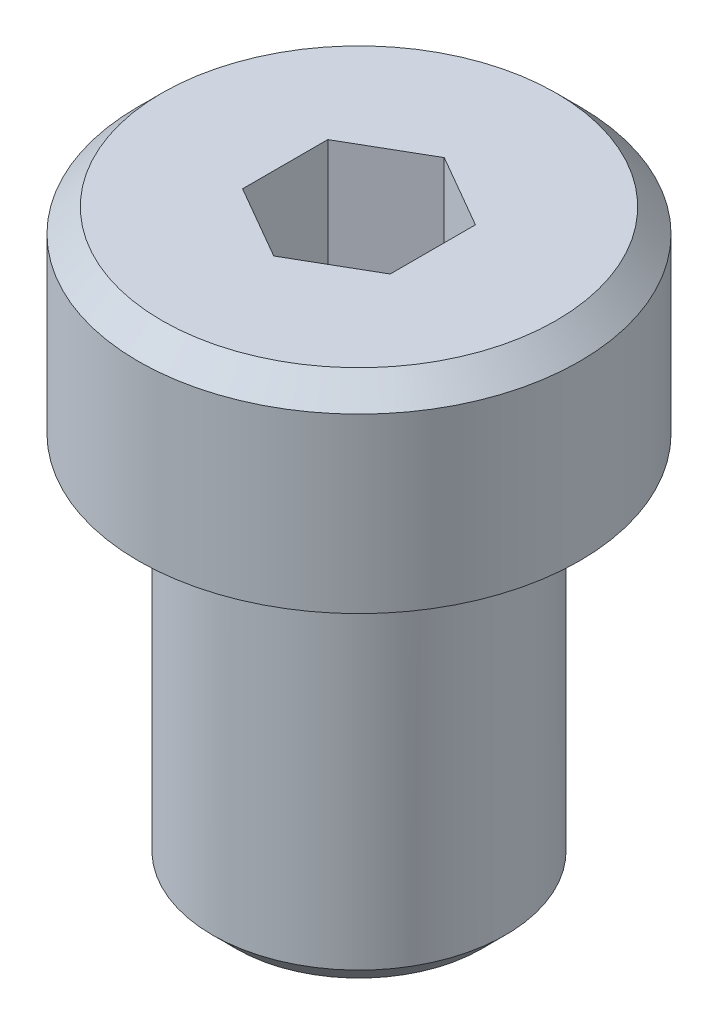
ISO-10303-21;
HEADER;
FILE_DESCRIPTION(('STEP AP214'),'2;1');
FILE_NAME('part.step','',(''),(''),'','','');
FILE_SCHEMA(('AUTOMOTIVE_DESIGN { 1 0 10303 214 1 1 1 1 }'));
ENDSEC;
DATA;
#1=APPLICATION_CONTEXT('core data for automotive mechanical design processes');
#2=APPLICATION_PROTOCOL_DEFINITION('international standard','automotive_design',2000,#1);
#3=PRODUCT_CONTEXT('',#1,'mechanical');
#4=PRODUCT('Part','Part','',(#3));
#5=PRODUCT_RELATED_PRODUCT_CATEGORY('part','',(#4));
#6=PRODUCT_DEFINITION_FORMATION('','',#4);
#7=PRODUCT_DEFINITION_CONTEXT('part definition',#1,'design');
#8=PRODUCT_DEFINITION('design','',#6,#7);
#9=PRODUCT_DEFINITION_SHAPE('','',#8);
#10=(LENGTH_UNIT() NAMED_UNIT(*) SI_UNIT(.MILLI.,.METRE.));
#11=(NAMED_UNIT(*) PLANE_ANGLE_UNIT() SI_UNIT($,.RADIAN.));
#12=(NAMED_UNIT(*) SI_UNIT($,.STERADIAN.) SOLID_ANGLE_UNIT());
#13=UNCERTAINTY_MEASURE_WITH_UNIT(LENGTH_MEASURE(1.E-05),#10,'distance_accuracy_value','');
#14=(GEOMETRIC_REPRESENTATION_CONTEXT(3) GLOBAL_UNCERTAINTY_ASSIGNED_CONTEXT((#13)) GLOBAL_UNIT_ASSIGNED_CONTEXT((#10,
#11,#12)) REPRESENTATION_CONTEXT('',''));
#15=CARTESIAN_POINT('',(0.,0.,0.));
#16=DIRECTION('',(0.,0.,1.));
#17=DIRECTION('',(1.,0.,0.));
#18=AXIS2_PLACEMENT_3D('',#15,#16,#17);
#19=CARTESIAN_POINT('',(0.,0.,0.));
#20=DIRECTION('',(0.,-1.,0.));
#21=DIRECTION('',(1.,0.,0.));
#22=AXIS2_PLACEMENT_3D('',#19,#20,#21);
#23=PLANE('',#22);
#24=CARTESIAN_POINT('',(0.,0.,0.));
#25=DIRECTION('',(0.,-1.,0.));
#26=DIRECTION('',(1.,0.,0.));
#27=AXIS2_PLACEMENT_3D('',#24,#25,#26);
#28=CIRCLE('',#27,4.7371);
#29=CARTESIAN_POINT('',(4.7371,0.,0.));
#30=VERTEX_POINT('',#29);
#31=EDGE_CURVE('E148',#30,#30,#28,.T.);
#32=ORIENTED_EDGE('',*,*,#31,.F.);
#33=EDGE_LOOP('',(#32));
#34=FACE_BOUND('',#33,.T.);
#35=CARTESIAN_POINT('',(0.,0.,0.));
#36=DIRECTION('',(0.,-1.,0.));
#37=DIRECTION('',(1.,0.,0.));
#38=AXIS2_PLACEMENT_3D('',#35,#36,#37);
#39=CIRCLE('',#38,7.137393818);
#40=CARTESIAN_POINT('',(7.137393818,0.,0.));
#41=VERTEX_POINT('',#40);
#42=EDGE_CURVE('E145',#41,#41,#39,.T.);
#43=ORIENTED_EDGE('',*,*,#42,.T.);
#44=EDGE_LOOP('',(#43));
#45=FACE_BOUND('',#44,.T.);
#46=ADVANCED_FACE('F32',(#34,#45),#23,.T.);
#47=CARTESIAN_POINT('',(0.,0.,0.));
#48=DIRECTION('',(0.,-1.,0.));
#49=DIRECTION('',(1.,0.,0.));
#50=AXIS2_PLACEMENT_3D('',#47,#48,#49);
#51=CYLINDRICAL_SURFACE('',#50,7.137393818);
#52=CARTESIAN_POINT('',(0.,5.5879945,0.));
#53=DIRECTION('',(0.,-1.,0.));
#54=DIRECTION('',(1.,0.,0.));
#55=AXIS2_PLACEMENT_3D('',#52,#53,#54);
#56=CIRCLE('',#55,7.137393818);
#57=CARTESIAN_POINT('',(7.137393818,5.5879945,0.));
#58=VERTEX_POINT('',#57);
#59=EDGE_CURVE('E142',#58,#58,#56,.T.);
#60=ORIENTED_EDGE('',*,*,#59,.T.);
#61=EDGE_LOOP('',(#60));
#62=FACE_BOUND('',#61,.T.);
#63=ORIENTED_EDGE('',*,*,#42,.F.);
#64=EDGE_LOOP('',(#63));
#65=FACE_BOUND('',#64,.T.);
#66=ADVANCED_FACE('F164',(#62,#65),#51,.T.);
#67=CARTESIAN_POINT('',(0.,5.5879945,0.));
#68=DIRECTION('',(0.,-1.,0.));
#69=DIRECTION('',(1.,0.,0.));
#70=AXIS2_PLACEMENT_3D('',#67,#68,#69);
#71=CONICAL_SURFACE('',#70,7.137393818,0.785398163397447);
#72=CARTESIAN_POINT('',(0.,6.3499945,0.));
#73=DIRECTION('',(0.,-1.,0.));
#74=DIRECTION('',(1.,0.,0.));
#75=AXIS2_PLACEMENT_3D('',#72,#73,#74);
#76=CIRCLE('',#75,6.375393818);
#77=CARTESIAN_POINT('',(6.375393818,6.3499945,0.));
#78=VERTEX_POINT('',#77);
#79=EDGE_CURVE('E134',#78,#78,#76,.T.);
#80=ORIENTED_EDGE('',*,*,#79,.T.);
#81=EDGE_LOOP('',(#80));
#82=FACE_BOUND('',#81,.T.);
#83=ORIENTED_EDGE('',*,*,#59,.F.);
#84=EDGE_LOOP('',(#83));
#85=FACE_BOUND('',#84,.T.);
#86=ADVANCED_FACE('F169',(#82,#85),#71,.T.);
#87=CARTESIAN_POINT('',(6.375393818,6.3499945,0.));
#88=DIRECTION('',(0.,1.,0.));
#89=DIRECTION('',(-1.,0.,0.));
#90=AXIS2_PLACEMENT_3D('',#87,#88,#89);
#91=PLANE('',#90);
#92=DIRECTION('',(-4.53589793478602E-07,0.,0.999999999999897));
#93=VECTOR('',#92,1.);
#94=CARTESIAN_POINT('',(-2.38759668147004,6.3499945,-1.37848223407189));
#95=LINE('',#94,#93);
#96=CARTESIAN_POINT('',(-2.38759668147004,6.3499945,-1.37848223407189));
#97=VERTEX_POINT('',#96);
#98=CARTESIAN_POINT('',(-2.387597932,6.3499945,1.37848006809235));
#99=VERTEX_POINT('',#98);
#100=EDGE_CURVE('E47',#97,#99,#95,.T.);
#101=ORIENTED_EDGE('',*,*,#100,.F.);
#102=DIRECTION('',(-0.866025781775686,0.,0.499999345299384));
#103=VECTOR('',#102,1.);
#104=CARTESIAN_POINT('',(1.87579371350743E-06,6.3499945,-2.75696049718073));
#105=LINE('',#104,#103);
#106=CARTESIAN_POINT('',(1.87579371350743E-06,6.3499945,-2.75696049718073));
#107=VERTEX_POINT('',#106);
#108=EDGE_CURVE('E130',#107,#97,#105,.T.);
#109=ORIENTED_EDGE('',*,*,#108,.F.);
#110=DIRECTION('',(-0.866025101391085,0.,-0.500000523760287));
#111=VECTOR('',#110,1.);
#112=CARTESIAN_POINT('',(2.38759855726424,6.3499945,-1.37847898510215));
#113=LINE('',#112,#111);
#114=CARTESIAN_POINT('',(2.38759855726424,6.3499945,-1.37847898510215));
#115=VERTEX_POINT('',#114);
#116=EDGE_CURVE('E128',#115,#107,#113,.T.);
#117=ORIENTED_EDGE('',*,*,#116,.F.);
#118=DIRECTION('',(4.53589793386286E-07,0.,-0.999999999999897));
#119=VECTOR('',#118,1.);
#120=CARTESIAN_POINT('',(2.38759730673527,6.3499945,1.37848115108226));
#121=LINE('',#120,#119);
#122=CARTESIAN_POINT('',(2.38759730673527,6.3499945,1.37848115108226));
#123=VERTEX_POINT('',#122);
#124=EDGE_CURVE('E95',#123,#115,#121,.T.);
#125=ORIENTED_EDGE('',*,*,#124,.F.);
#126=DIRECTION('',(0.866025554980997,0.,-0.499999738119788));
#127=VECTOR('',#126,1.);
#128=CARTESIAN_POINT('',(-6.25264571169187E-07,6.3499945,2.7569604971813));
#129=LINE('',#128,#127);
#130=CARTESIAN_POINT('',(-6.25264571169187E-07,6.3499945,2.7569604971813));
#131=VERTEX_POINT('',#130);
#132=EDGE_CURVE('E124',#131,#123,#129,.T.);
#133=ORIENTED_EDGE('',*,*,#132,.F.);
#134=DIRECTION('',(0.86602532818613,0.,0.500000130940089));
#135=VECTOR('',#134,1.);
#136=CARTESIAN_POINT('',(-2.387597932,6.3499945,1.37848006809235));
#137=LINE('',#136,#135);
#138=EDGE_CURVE('E121',#99,#131,#137,.T.);
#139=ORIENTED_EDGE('',*,*,#138,.F.);
#140=EDGE_LOOP('',(#101,#109,#117,#125,#133,#139));
#141=FACE_BOUND('',#140,.T.);
#142=ORIENTED_EDGE('',*,*,#79,.F.);
#143=EDGE_LOOP('',(#142));
#144=FACE_BOUND('',#143,.T.);
#145=ADVANCED_FACE('F177',(#141,#144),#91,.T.);
#146=CARTESIAN_POINT('',(0.,-12.446,0.));
#147=DIRECTION('',(0.,-1.,0.));
#148=DIRECTION('',(0.,0.,-1.));
#149=AXIS2_PLACEMENT_3D('',#146,#147,#148);
#150=PLANE('',#149);
#151=CARTESIAN_POINT('',(0.,-12.446,0.));
#152=DIRECTION('',(0.,-1.,0.));
#153=DIRECTION('',(0.,0.,-1.));
#154=AXIS2_PLACEMENT_3D('',#151,#152,#153);
#155=CIRCLE('',#154,3.9751);
#156=CARTESIAN_POINT('',(0.,-12.446,-3.9751));
#157=VERTEX_POINT('',#156);
#158=EDGE_CURVE('E40',#157,#157,#155,.T.);
#159=ORIENTED_EDGE('',*,*,#158,.T.);
#160=EDGE_LOOP('',(#159));
#161=FACE_BOUND('',#160,.T.);
#162=ADVANCED_FACE('F153',(#161),#150,.T.);
#163=CARTESIAN_POINT('',(0.,0.,0.));
#164=DIRECTION('',(0.,-1.,0.));
#165=DIRECTION('',(0.,0.,-1.));
#166=AXIS2_PLACEMENT_3D('',#163,#164,#165);
#167=CYLINDRICAL_SURFACE('',#166,4.7371);
#168=CARTESIAN_POINT('',(0.,-11.684,0.));
#169=DIRECTION('',(0.,-1.,0.));
#170=DIRECTION('',(0.,0.,-1.));
#171=AXIS2_PLACEMENT_3D('',#168,#169,#170);
#172=CIRCLE('',#171,4.7371);
#173=CARTESIAN_POINT('',(0.,-11.684,-4.7371));
#174=VERTEX_POINT('',#173);
#175=EDGE_CURVE('E11',#174,#174,#172,.F.);
#176=ORIENTED_EDGE('',*,*,#175,.T.);
#177=EDGE_LOOP('',(#176));
#178=FACE_BOUND('',#177,.T.);
#179=ORIENTED_EDGE('',*,*,#31,.T.);
#180=EDGE_LOOP('',(#179));
#181=FACE_BOUND('',#180,.T.);
#182=ADVANCED_FACE('F184',(#178,#181),#167,.T.);
#183=CARTESIAN_POINT('',(-2.38759668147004,2.768597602,-1.37848223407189));
#184=DIRECTION('',(-0.999999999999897,0.,-4.53589793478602E-07));
#185=DIRECTION('',(-4.53589793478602E-07,0.,0.999999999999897));
#186=AXIS2_PLACEMENT_3D('',#183,#184,#185);
#187=PLANE('',#186);
#188=ORIENTED_EDGE('',*,*,#100,.T.);
#189=DIRECTION('',(0.,1.,0.));
#190=VECTOR('',#189,1.);
#191=CARTESIAN_POINT('',(-2.387597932,2.768597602,1.37848006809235));
#192=LINE('',#191,#190);
#193=CARTESIAN_POINT('',(-2.387597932,2.768597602,1.37848006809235));
#194=VERTEX_POINT('',#193);
#195=EDGE_CURVE('E77',#194,#99,#192,.T.);
#196=ORIENTED_EDGE('',*,*,#195,.F.);
#197=DIRECTION('',(-4.53589793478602E-07,0.,0.999999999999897));
#198=VECTOR('',#197,1.);
#199=CARTESIAN_POINT('',(-2.38759668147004,2.768597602,-1.37848223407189));
#200=LINE('',#199,#198);
#201=CARTESIAN_POINT('',(-2.38759668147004,2.768597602,-1.37848223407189));
#202=VERTEX_POINT('',#201);
#203=EDGE_CURVE('E132',#202,#194,#200,.T.);
#204=ORIENTED_EDGE('',*,*,#203,.F.);
#205=DIRECTION('',(0.,1.,0.));
#206=VECTOR('',#205,1.);
#207=CARTESIAN_POINT('',(-2.38759668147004,2.768597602,-1.37848223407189));
#208=LINE('',#207,#206);
#209=EDGE_CURVE('E55',#202,#97,#208,.T.);
#210=ORIENTED_EDGE('',*,*,#209,.T.);
#211=EDGE_LOOP('',(#188,#196,#204,#210));
#212=FACE_BOUND('',#211,.T.);
#213=ADVANCED_FACE('F187',(#212),#187,.F.);
#214=CARTESIAN_POINT('',(1.87579371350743E-06,2.768597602,-2.75696049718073));
#215=DIRECTION('',(-0.499999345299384,0.,-0.866025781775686));
#216=DIRECTION('',(-0.866025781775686,0.,0.499999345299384));
#217=AXIS2_PLACEMENT_3D('',#214,#215,#216);
#218=PLANE('',#217);
#219=ORIENTED_EDGE('',*,*,#108,.T.);
#220=ORIENTED_EDGE('',*,*,#209,.F.);
#221=DIRECTION('',(-0.866025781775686,0.,0.499999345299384));
#222=VECTOR('',#221,1.);
#223=CARTESIAN_POINT('',(1.87579371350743E-06,2.768597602,-2.75696049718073));
#224=LINE('',#223,#222);
#225=CARTESIAN_POINT('',(1.87579371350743E-06,2.768597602,-2.75696049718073));
#226=VERTEX_POINT('',#225);
#227=EDGE_CURVE('E107',#226,#202,#224,.T.);
#228=ORIENTED_EDGE('',*,*,#227,.F.);
#229=DIRECTION('',(0.,1.,0.));
#230=VECTOR('',#229,1.);
#231=CARTESIAN_POINT('',(1.87579371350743E-06,2.768597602,-2.75696049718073));
#232=LINE('',#231,#230);
#233=EDGE_CURVE('E99',#226,#107,#232,.T.);
#234=ORIENTED_EDGE('',*,*,#233,.T.);
#235=EDGE_LOOP('',(#219,#220,#228,#234));
#236=FACE_BOUND('',#235,.T.);
#237=ADVANCED_FACE('F191',(#236),#218,.F.);
#238=CARTESIAN_POINT('',(2.38759855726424,2.768597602,-1.37847898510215));
#239=DIRECTION('',(0.500000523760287,0.,-0.866025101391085));
#240=DIRECTION('',(-0.866025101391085,0.,-0.500000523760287));
#241=AXIS2_PLACEMENT_3D('',#238,#239,#240);
#242=PLANE('',#241);
#243=ORIENTED_EDGE('',*,*,#116,.T.);
#244=ORIENTED_EDGE('',*,*,#233,.F.);
#245=DIRECTION('',(-0.866025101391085,0.,-0.500000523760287));
#246=VECTOR('',#245,1.);
#247=CARTESIAN_POINT('',(2.38759855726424,2.768597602,-1.37847898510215));
#248=LINE('',#247,#246);
#249=CARTESIAN_POINT('',(2.38759855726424,2.768597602,-1.37847898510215));
#250=VERTEX_POINT('',#249);
#251=EDGE_CURVE('E103',#250,#226,#248,.T.);
#252=ORIENTED_EDGE('',*,*,#251,.F.);
#253=DIRECTION('',(0.,1.,0.));
#254=VECTOR('',#253,1.);
#255=CARTESIAN_POINT('',(2.38759855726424,2.768597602,-1.37847898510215));
#256=LINE('',#255,#254);
#257=EDGE_CURVE('E88',#250,#115,#256,.T.);
#258=ORIENTED_EDGE('',*,*,#257,.T.);
#259=EDGE_LOOP('',(#243,#244,#252,#258));
#260=FACE_BOUND('',#259,.T.);
#261=ADVANCED_FACE('F104',(#260),#242,.F.);
#262=CARTESIAN_POINT('',(2.38759730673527,2.768597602,1.37848115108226));
#263=DIRECTION('',(0.999999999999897,0.,4.53589793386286E-07));
#264=DIRECTION('',(4.53589793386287E-07,0.,-0.999999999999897));
#265=AXIS2_PLACEMENT_3D('',#262,#263,#264);
#266=PLANE('',#265);
#267=ORIENTED_EDGE('',*,*,#124,.T.);
#268=ORIENTED_EDGE('',*,*,#257,.F.);
#269=DIRECTION('',(4.53589793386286E-07,0.,-0.999999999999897));
#270=VECTOR('',#269,1.);
#271=CARTESIAN_POINT('',(2.38759730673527,2.768597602,1.37848115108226));
#272=LINE('',#271,#270);
#273=CARTESIAN_POINT('',(2.38759730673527,2.768597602,1.37848115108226));
#274=VERTEX_POINT('',#273);
#275=EDGE_CURVE('E92',#274,#250,#272,.T.);
#276=ORIENTED_EDGE('',*,*,#275,.F.);
#277=DIRECTION('',(0.,1.,0.));
#278=VECTOR('',#277,1.);
#279=CARTESIAN_POINT('',(2.38759730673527,2.768597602,1.37848115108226));
#280=LINE('',#279,#278);
#281=EDGE_CURVE('E100',#274,#123,#280,.T.);
#282=ORIENTED_EDGE('',*,*,#281,.T.);
#283=EDGE_LOOP('',(#267,#268,#276,#282));
#284=FACE_BOUND('',#283,.T.);
#285=ADVANCED_FACE('F90',(#284),#266,.F.);
#286=CARTESIAN_POINT('',(-6.25264571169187E-07,2.768597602,2.7569604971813));
#287=DIRECTION('',(0.499999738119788,0.,0.866025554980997));
#288=DIRECTION('',(0.866025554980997,0.,-0.499999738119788));
#289=AXIS2_PLACEMENT_3D('',#286,#287,#288);
#290=PLANE('',#289);
#291=ORIENTED_EDGE('',*,*,#132,.T.);
#292=ORIENTED_EDGE('',*,*,#281,.F.);
#293=DIRECTION('',(0.866025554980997,0.,-0.499999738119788));
#294=VECTOR('',#293,1.);
#295=CARTESIAN_POINT('',(-6.25264571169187E-07,2.768597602,2.7569604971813));
#296=LINE('',#295,#294);
#297=CARTESIAN_POINT('',(-6.25264571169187E-07,2.768597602,2.7569604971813));
#298=VERTEX_POINT('',#297);
#299=EDGE_CURVE('E113',#298,#274,#296,.T.);
#300=ORIENTED_EDGE('',*,*,#299,.F.);
#301=DIRECTION('',(0.,1.,0.));
#302=VECTOR('',#301,1.);
#303=CARTESIAN_POINT('',(-6.25264571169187E-07,2.768597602,2.7569604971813));
#304=LINE('',#303,#302);
#305=EDGE_CURVE('E137',#298,#131,#304,.T.);
#306=ORIENTED_EDGE('',*,*,#305,.T.);
#307=EDGE_LOOP('',(#291,#292,#300,#306));
#308=FACE_BOUND('',#307,.T.);
#309=ADVANCED_FACE('F194',(#308),#290,.F.);
#310=CARTESIAN_POINT('',(-2.387597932,2.768597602,1.37848006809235));
#311=DIRECTION('',(-0.500000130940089,0.,0.86602532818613));
#312=DIRECTION('',(0.86602532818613,0.,0.500000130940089));
#313=AXIS2_PLACEMENT_3D('',#310,#311,#312);
#314=PLANE('',#313);
#315=ORIENTED_EDGE('',*,*,#138,.T.);
#316=ORIENTED_EDGE('',*,*,#305,.F.);
#317=DIRECTION('',(0.86602532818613,0.,0.500000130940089));
#318=VECTOR('',#317,1.);
#319=CARTESIAN_POINT('',(-2.387597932,2.768597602,1.37848006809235));
#320=LINE('',#319,#318);
#321=EDGE_CURVE('E115',#194,#298,#320,.T.);
#322=ORIENTED_EDGE('',*,*,#321,.F.);
#323=ORIENTED_EDGE('',*,*,#195,.T.);
#324=EDGE_LOOP('',(#315,#316,#322,#323));
#325=FACE_BOUND('',#324,.T.);
#326=ADVANCED_FACE('F160',(#325),#314,.F.);
#327=CARTESIAN_POINT('',(-2.387597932,2.768597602,1.37848006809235));
#328=DIRECTION('',(0.,1.,0.));
#329=DIRECTION('',(0.,0.,1.));
#330=AXIS2_PLACEMENT_3D('',#327,#328,#329);
#331=PLANE('',#330);
#332=ORIENTED_EDGE('',*,*,#203,.T.);
#333=ORIENTED_EDGE('',*,*,#321,.T.);
#334=ORIENTED_EDGE('',*,*,#299,.T.);
#335=ORIENTED_EDGE('',*,*,#275,.T.);
#336=ORIENTED_EDGE('',*,*,#251,.T.);
#337=ORIENTED_EDGE('',*,*,#227,.T.);
#338=EDGE_LOOP('',(#332,#333,#334,#335,#336,#337));
#339=FACE_BOUND('',#338,.T.);
#340=ADVANCED_FACE('F110',(#339),#331,.T.);
#341=CARTESIAN_POINT('',(0.,-12.446,0.));
#342=DIRECTION('',(0.,1.,0.));
#343=DIRECTION('',(0.,0.,1.));
#344=AXIS2_PLACEMENT_3D('',#341,#342,#343);
#345=CONICAL_SURFACE('',#344,3.9751,0.785398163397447);
#346=ORIENTED_EDGE('',*,*,#175,.F.);
#347=EDGE_LOOP('',(#346));
#348=FACE_BOUND('',#347,.T.);
#349=ORIENTED_EDGE('',*,*,#158,.F.);
#350=EDGE_LOOP('',(#349));
#351=FACE_BOUND('',#350,.T.);
#352=ADVANCED_FACE('F34',(#348,#351),#345,.T.);
#353=CLOSED_SHELL('',(#46,#66,#86,#145,#162,#182,#213,#237,#261,#285,#309,#326,#340,#352));
#354=MANIFOLD_SOLID_BREP('B2',#353);
#355=ADVANCED_BREP_SHAPE_REPRESENTATION('',(#18,#354),#14);
#356=SHAPE_DEFINITION_REPRESENTATION(#9,#355);
ENDSEC;
END-ISO-10303-21;
